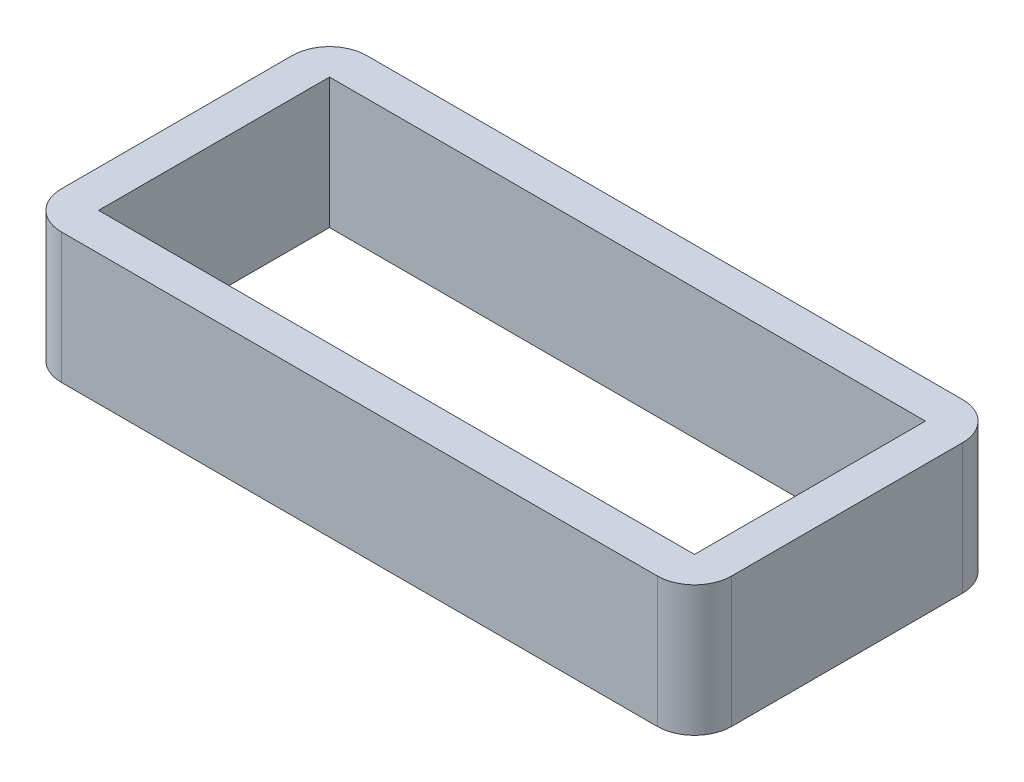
ISO-10303-21;
HEADER;
FILE_DESCRIPTION(('STEP AP214'),'2;1');
FILE_NAME('part.step','',(''),(''),'','','');
FILE_SCHEMA(('AUTOMOTIVE_DESIGN { 1 0 10303 214 1 1 1 1 }'));
ENDSEC;
DATA;
#1=APPLICATION_CONTEXT('core data for automotive mechanical design processes');
#2=APPLICATION_PROTOCOL_DEFINITION('international standard','automotive_design',2000,#1);
#3=PRODUCT_CONTEXT('',#1,'mechanical');
#4=PRODUCT('Part','Part','',(#3));
#5=PRODUCT_RELATED_PRODUCT_CATEGORY('part','',(#4));
#6=PRODUCT_DEFINITION_FORMATION('','',#4);
#7=PRODUCT_DEFINITION_CONTEXT('part definition',#1,'design');
#8=PRODUCT_DEFINITION('design','',#6,#7);
#9=PRODUCT_DEFINITION_SHAPE('','',#8);
#10=(LENGTH_UNIT() NAMED_UNIT(*) SI_UNIT(.MILLI.,.METRE.));
#11=(NAMED_UNIT(*) PLANE_ANGLE_UNIT() SI_UNIT($,.RADIAN.));
#12=(NAMED_UNIT(*) SI_UNIT($,.STERADIAN.) SOLID_ANGLE_UNIT());
#13=UNCERTAINTY_MEASURE_WITH_UNIT(LENGTH_MEASURE(1.E-05),#10,'distance_accuracy_value','');
#14=(GEOMETRIC_REPRESENTATION_CONTEXT(3) GLOBAL_UNCERTAINTY_ASSIGNED_CONTEXT((#13)) GLOBAL_UNIT_ASSIGNED_CONTEXT((#10,
#11,#12)) REPRESENTATION_CONTEXT('',''));
#15=CARTESIAN_POINT('',(0.,0.,0.));
#16=DIRECTION('',(0.,0.,1.));
#17=DIRECTION('',(1.,0.,0.));
#18=AXIS2_PLACEMENT_3D('',#15,#16,#17);
#19=CARTESIAN_POINT('',(-16.,-39.5595753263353,6.2));
#20=DIRECTION('',(0.,1.,0.));
#21=DIRECTION('',(0.,0.,1.));
#22=AXIS2_PLACEMENT_3D('',#19,#20,#21);
#23=CYLINDRICAL_SURFACE('',#22,1.99999999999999);
#24=DIRECTION('',(0.,1.,0.));
#25=VECTOR('',#24,1.);
#26=CARTESIAN_POINT('',(-18.,-39.5595753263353,6.20000000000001));
#27=LINE('',#26,#25);
#28=CARTESIAN_POINT('',(-18.,0.,6.20000000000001));
#29=VERTEX_POINT('',#28);
#30=CARTESIAN_POINT('',(-18.,7.,6.20000000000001));
#31=VERTEX_POINT('',#30);
#32=EDGE_CURVE('E134',#29,#31,#27,.T.);
#33=ORIENTED_EDGE('',*,*,#32,.F.);
#34=CARTESIAN_POINT('',(-16.,0.,6.2));
#35=DIRECTION('',(0.,-1.,0.));
#36=DIRECTION('',(0.,0.,-1.));
#37=AXIS2_PLACEMENT_3D('',#34,#35,#36);
#38=CIRCLE('',#37,1.99999999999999);
#39=CARTESIAN_POINT('',(-16.,0.,8.19999999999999));
#40=VERTEX_POINT('',#39);
#41=EDGE_CURVE('E128',#29,#40,#38,.F.);
#42=ORIENTED_EDGE('',*,*,#41,.T.);
#43=DIRECTION('',(0.,1.,0.));
#44=VECTOR('',#43,1.);
#45=CARTESIAN_POINT('',(-16.,-39.5595753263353,8.19999999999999));
#46=LINE('',#45,#44);
#47=CARTESIAN_POINT('',(-16.,7.,8.19999999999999));
#48=VERTEX_POINT('',#47);
#49=EDGE_CURVE('E130',#40,#48,#46,.T.);
#50=ORIENTED_EDGE('',*,*,#49,.T.);
#51=CARTESIAN_POINT('',(-16.,7.,6.2));
#52=DIRECTION('',(0.,1.,0.));
#53=DIRECTION('',(0.,0.,1.));
#54=AXIS2_PLACEMENT_3D('',#51,#52,#53);
#55=CIRCLE('',#54,1.99999999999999);
#56=EDGE_CURVE('E176',#31,#48,#55,.T.);
#57=ORIENTED_EDGE('',*,*,#56,.F.);
#58=EDGE_LOOP('',(#33,#42,#50,#57));
#59=FACE_BOUND('',#58,.T.);
#60=ADVANCED_FACE('F16',(#59),#23,.T.);
#61=CARTESIAN_POINT('',(-18.,-39.5595753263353,-6.2));
#62=DIRECTION('',(-1.,0.,0.));
#63=DIRECTION('',(0.,0.,1.));
#64=AXIS2_PLACEMENT_3D('',#61,#62,#63);
#65=PLANE('',#64);
#66=DIRECTION('',(0.,1.,0.));
#67=VECTOR('',#66,1.);
#68=CARTESIAN_POINT('',(-18.,-39.5595753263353,-6.2));
#69=LINE('',#68,#67);
#70=CARTESIAN_POINT('',(-18.,0.,-6.2));
#71=VERTEX_POINT('',#70);
#72=CARTESIAN_POINT('',(-18.,7.,-6.2));
#73=VERTEX_POINT('',#72);
#74=EDGE_CURVE('E138',#71,#73,#69,.T.);
#75=ORIENTED_EDGE('',*,*,#74,.F.);
#76=DIRECTION('',(0.,0.,1.));
#77=VECTOR('',#76,1.);
#78=CARTESIAN_POINT('',(-18.,0.,-6.2));
#79=LINE('',#78,#77);
#80=EDGE_CURVE('E131',#71,#29,#79,.T.);
#81=ORIENTED_EDGE('',*,*,#80,.T.);
#82=ORIENTED_EDGE('',*,*,#32,.T.);
#83=DIRECTION('',(0.,0.,1.));
#84=VECTOR('',#83,1.);
#85=CARTESIAN_POINT('',(-18.,7.,-6.2));
#86=LINE('',#85,#84);
#87=EDGE_CURVE('E123',#73,#31,#86,.T.);
#88=ORIENTED_EDGE('',*,*,#87,.F.);
#89=EDGE_LOOP('',(#75,#81,#82,#88));
#90=FACE_BOUND('',#89,.T.);
#91=ADVANCED_FACE('F208',(#90),#65,.T.);
#92=CARTESIAN_POINT('',(-16.,-39.5595753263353,-6.2));
#93=DIRECTION('',(0.,1.,0.));
#94=DIRECTION('',(0.,0.,1.));
#95=AXIS2_PLACEMENT_3D('',#92,#93,#94);
#96=CYLINDRICAL_SURFACE('',#95,1.99999999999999);
#97=DIRECTION('',(0.,1.,0.));
#98=VECTOR('',#97,1.);
#99=CARTESIAN_POINT('',(-16.,-39.5595753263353,-8.19999999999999));
#100=LINE('',#99,#98);
#101=CARTESIAN_POINT('',(-16.,0.,-8.19999999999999));
#102=VERTEX_POINT('',#101);
#103=CARTESIAN_POINT('',(-16.,7.,-8.19999999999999));
#104=VERTEX_POINT('',#103);
#105=EDGE_CURVE('E142',#102,#104,#100,.T.);
#106=ORIENTED_EDGE('',*,*,#105,.F.);
#107=CARTESIAN_POINT('',(-16.,0.,-6.2));
#108=DIRECTION('',(0.,-1.,0.));
#109=DIRECTION('',(0.,0.,-1.));
#110=AXIS2_PLACEMENT_3D('',#107,#108,#109);
#111=CIRCLE('',#110,1.99999999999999);
#112=EDGE_CURVE('E135',#102,#71,#111,.F.);
#113=ORIENTED_EDGE('',*,*,#112,.T.);
#114=ORIENTED_EDGE('',*,*,#74,.T.);
#115=CARTESIAN_POINT('',(-16.,7.,-6.2));
#116=DIRECTION('',(0.,1.,0.));
#117=DIRECTION('',(0.,0.,1.));
#118=AXIS2_PLACEMENT_3D('',#115,#116,#117);
#119=CIRCLE('',#118,1.99999999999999);
#120=EDGE_CURVE('E200',#104,#73,#119,.T.);
#121=ORIENTED_EDGE('',*,*,#120,.F.);
#122=EDGE_LOOP('',(#106,#113,#114,#121));
#123=FACE_BOUND('',#122,.T.);
#124=ADVANCED_FACE('F232',(#123),#96,.T.);
#125=CARTESIAN_POINT('',(16.,-39.5595753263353,-8.2));
#126=DIRECTION('',(0.,0.,-1.));
#127=DIRECTION('',(-1.,0.,0.));
#128=AXIS2_PLACEMENT_3D('',#125,#126,#127);
#129=PLANE('',#128);
#130=DIRECTION('',(0.,1.,0.));
#131=VECTOR('',#130,1.);
#132=CARTESIAN_POINT('',(16.,-39.5595753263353,-8.2));
#133=LINE('',#132,#131);
#134=CARTESIAN_POINT('',(16.,0.,-8.2));
#135=VERTEX_POINT('',#134);
#136=CARTESIAN_POINT('',(16.,7.,-8.2));
#137=VERTEX_POINT('',#136);
#138=EDGE_CURVE('E146',#135,#137,#133,.T.);
#139=ORIENTED_EDGE('',*,*,#138,.F.);
#140=DIRECTION('',(-1.,0.,0.));
#141=VECTOR('',#140,1.);
#142=CARTESIAN_POINT('',(16.,0.,-8.2));
#143=LINE('',#142,#141);
#144=EDGE_CURVE('E139',#135,#102,#143,.T.);
#145=ORIENTED_EDGE('',*,*,#144,.T.);
#146=ORIENTED_EDGE('',*,*,#105,.T.);
#147=DIRECTION('',(-1.,0.,0.));
#148=VECTOR('',#147,1.);
#149=CARTESIAN_POINT('',(16.,7.,-8.2));
#150=LINE('',#149,#148);
#151=EDGE_CURVE('E197',#137,#104,#150,.T.);
#152=ORIENTED_EDGE('',*,*,#151,.F.);
#153=EDGE_LOOP('',(#139,#145,#146,#152));
#154=FACE_BOUND('',#153,.T.);
#155=ADVANCED_FACE('F229',(#154),#129,.T.);
#156=CARTESIAN_POINT('',(16.,-39.5595753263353,-6.2));
#157=DIRECTION('',(0.,1.,0.));
#158=DIRECTION('',(0.,0.,1.));
#159=AXIS2_PLACEMENT_3D('',#156,#157,#158);
#160=CYLINDRICAL_SURFACE('',#159,2.);
#161=DIRECTION('',(0.,1.,0.));
#162=VECTOR('',#161,1.);
#163=CARTESIAN_POINT('',(18.,-39.5595753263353,-6.2));
#164=LINE('',#163,#162);
#165=CARTESIAN_POINT('',(18.,0.,-6.2));
#166=VERTEX_POINT('',#165);
#167=CARTESIAN_POINT('',(18.,7.,-6.2));
#168=VERTEX_POINT('',#167);
#169=EDGE_CURVE('E150',#166,#168,#164,.T.);
#170=ORIENTED_EDGE('',*,*,#169,.F.);
#171=CARTESIAN_POINT('',(16.,0.,-6.2));
#172=DIRECTION('',(0.,-1.,0.));
#173=DIRECTION('',(0.,0.,-1.));
#174=AXIS2_PLACEMENT_3D('',#171,#172,#173);
#175=CIRCLE('',#174,2.);
#176=EDGE_CURVE('E143',#166,#135,#175,.F.);
#177=ORIENTED_EDGE('',*,*,#176,.T.);
#178=ORIENTED_EDGE('',*,*,#138,.T.);
#179=CARTESIAN_POINT('',(16.,7.,-6.2));
#180=DIRECTION('',(0.,1.,0.));
#181=DIRECTION('',(0.,0.,1.));
#182=AXIS2_PLACEMENT_3D('',#179,#180,#181);
#183=CIRCLE('',#182,2.);
#184=EDGE_CURVE('E194',#168,#137,#183,.T.);
#185=ORIENTED_EDGE('',*,*,#184,.F.);
#186=EDGE_LOOP('',(#170,#177,#178,#185));
#187=FACE_BOUND('',#186,.T.);
#188=ADVANCED_FACE('F225',(#187),#160,.T.);
#189=CARTESIAN_POINT('',(18.,-39.5595753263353,6.20000000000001));
#190=DIRECTION('',(1.,0.,0.));
#191=DIRECTION('',(0.,0.,-1.));
#192=AXIS2_PLACEMENT_3D('',#189,#190,#191);
#193=PLANE('',#192);
#194=DIRECTION('',(0.,1.,0.));
#195=VECTOR('',#194,1.);
#196=CARTESIAN_POINT('',(18.,-39.5595753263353,6.20000000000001));
#197=LINE('',#196,#195);
#198=CARTESIAN_POINT('',(18.,0.,6.20000000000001));
#199=VERTEX_POINT('',#198);
#200=CARTESIAN_POINT('',(18.,7.,6.20000000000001));
#201=VERTEX_POINT('',#200);
#202=EDGE_CURVE('E153',#199,#201,#197,.T.);
#203=ORIENTED_EDGE('',*,*,#202,.F.);
#204=DIRECTION('',(0.,0.,-1.));
#205=VECTOR('',#204,1.);
#206=CARTESIAN_POINT('',(18.,0.,6.20000000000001));
#207=LINE('',#206,#205);
#208=EDGE_CURVE('E147',#199,#166,#207,.T.);
#209=ORIENTED_EDGE('',*,*,#208,.T.);
#210=ORIENTED_EDGE('',*,*,#169,.T.);
#211=DIRECTION('',(0.,0.,-1.));
#212=VECTOR('',#211,1.);
#213=CARTESIAN_POINT('',(18.,7.,6.20000000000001));
#214=LINE('',#213,#212);
#215=EDGE_CURVE('E189',#201,#168,#214,.T.);
#216=ORIENTED_EDGE('',*,*,#215,.F.);
#217=EDGE_LOOP('',(#203,#209,#210,#216));
#218=FACE_BOUND('',#217,.T.);
#219=ADVANCED_FACE('F222',(#218),#193,.T.);
#220=CARTESIAN_POINT('',(16.,-39.5595753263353,6.2));
#221=DIRECTION('',(0.,1.,0.));
#222=DIRECTION('',(0.,0.,1.));
#223=AXIS2_PLACEMENT_3D('',#220,#221,#222);
#224=CYLINDRICAL_SURFACE('',#223,2.);
#225=DIRECTION('',(0.,1.,0.));
#226=VECTOR('',#225,1.);
#227=CARTESIAN_POINT('',(16.,-39.5595753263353,8.19999999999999));
#228=LINE('',#227,#226);
#229=CARTESIAN_POINT('',(16.,0.,8.19999999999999));
#230=VERTEX_POINT('',#229);
#231=CARTESIAN_POINT('',(16.,7.,8.19999999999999));
#232=VERTEX_POINT('',#231);
#233=EDGE_CURVE('E161',#230,#232,#228,.T.);
#234=ORIENTED_EDGE('',*,*,#233,.F.);
#235=CARTESIAN_POINT('',(16.,0.,6.2));
#236=DIRECTION('',(0.,-1.,0.));
#237=DIRECTION('',(0.,0.,-1.));
#238=AXIS2_PLACEMENT_3D('',#235,#236,#237);
#239=CIRCLE('',#238,2.);
#240=EDGE_CURVE('E151',#230,#199,#239,.F.);
#241=ORIENTED_EDGE('',*,*,#240,.T.);
#242=ORIENTED_EDGE('',*,*,#202,.T.);
#243=CARTESIAN_POINT('',(16.,7.,6.2));
#244=DIRECTION('',(0.,1.,0.));
#245=DIRECTION('',(0.,0.,1.));
#246=AXIS2_PLACEMENT_3D('',#243,#244,#245);
#247=CIRCLE('',#246,2.);
#248=EDGE_CURVE('E186',#232,#201,#247,.T.);
#249=ORIENTED_EDGE('',*,*,#248,.F.);
#250=EDGE_LOOP('',(#234,#241,#242,#249));
#251=FACE_BOUND('',#250,.T.);
#252=ADVANCED_FACE('F217',(#251),#224,.T.);
#253=CARTESIAN_POINT('',(-16.,-39.5595753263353,8.19999999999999));
#254=DIRECTION('',(0.,0.,1.));
#255=DIRECTION('',(1.,0.,0.));
#256=AXIS2_PLACEMENT_3D('',#253,#254,#255);
#257=PLANE('',#256);
#258=ORIENTED_EDGE('',*,*,#49,.F.);
#259=DIRECTION('',(1.,0.,0.));
#260=VECTOR('',#259,1.);
#261=CARTESIAN_POINT('',(-16.,0.,8.19999999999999));
#262=LINE('',#261,#260);
#263=EDGE_CURVE('E34',#40,#230,#262,.T.);
#264=ORIENTED_EDGE('',*,*,#263,.T.);
#265=ORIENTED_EDGE('',*,*,#233,.T.);
#266=DIRECTION('',(1.,0.,0.));
#267=VECTOR('',#266,1.);
#268=CARTESIAN_POINT('',(-16.,7.,8.19999999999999));
#269=LINE('',#268,#267);
#270=EDGE_CURVE('E181',#48,#232,#269,.T.);
#271=ORIENTED_EDGE('',*,*,#270,.F.);
#272=EDGE_LOOP('',(#258,#264,#265,#271));
#273=FACE_BOUND('',#272,.T.);
#274=ADVANCED_FACE('F213',(#273),#257,.T.);
#275=CARTESIAN_POINT('',(-16.,-39.5595753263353,-6.2));
#276=DIRECTION('',(-1.,0.,0.));
#277=DIRECTION('',(0.,0.,1.));
#278=AXIS2_PLACEMENT_3D('',#275,#276,#277);
#279=PLANE('',#278);
#280=DIRECTION('',(0.,0.,1.));
#281=VECTOR('',#280,1.);
#282=CARTESIAN_POINT('',(-16.,0.,-6.2));
#283=LINE('',#282,#281);
#284=CARTESIAN_POINT('',(-16.,0.,-6.2));
#285=VERTEX_POINT('',#284);
#286=CARTESIAN_POINT('',(-16.,0.,6.19999999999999));
#287=VERTEX_POINT('',#286);
#288=EDGE_CURVE('E104',#285,#287,#283,.T.);
#289=ORIENTED_EDGE('',*,*,#288,.F.);
#290=DIRECTION('',(0.,1.,0.));
#291=VECTOR('',#290,1.);
#292=CARTESIAN_POINT('',(-16.,-39.5595753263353,-6.2));
#293=LINE('',#292,#291);
#294=CARTESIAN_POINT('',(-16.,7.,-6.2));
#295=VERTEX_POINT('',#294);
#296=EDGE_CURVE('E163',#285,#295,#293,.T.);
#297=ORIENTED_EDGE('',*,*,#296,.T.);
#298=DIRECTION('',(0.,0.,1.));
#299=VECTOR('',#298,1.);
#300=CARTESIAN_POINT('',(-16.,7.,-6.2));
#301=LINE('',#300,#299);
#302=CARTESIAN_POINT('',(-16.,7.,6.19999999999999));
#303=VERTEX_POINT('',#302);
#304=EDGE_CURVE('E107',#295,#303,#301,.T.);
#305=ORIENTED_EDGE('',*,*,#304,.T.);
#306=DIRECTION('',(0.,1.,0.));
#307=VECTOR('',#306,1.);
#308=CARTESIAN_POINT('',(-16.,-39.5595753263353,6.19999999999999));
#309=LINE('',#308,#307);
#310=EDGE_CURVE('E20',#287,#303,#309,.T.);
#311=ORIENTED_EDGE('',*,*,#310,.F.);
#312=EDGE_LOOP('',(#289,#297,#305,#311));
#313=FACE_BOUND('',#312,.T.);
#314=ADVANCED_FACE('F102',(#313),#279,.F.);
#315=CARTESIAN_POINT('',(16.,-39.5595753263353,-6.2));
#316=DIRECTION('',(0.,0.,-1.));
#317=DIRECTION('',(-1.,0.,0.));
#318=AXIS2_PLACEMENT_3D('',#315,#316,#317);
#319=PLANE('',#318);
#320=DIRECTION('',(-1.,0.,0.));
#321=VECTOR('',#320,1.);
#322=CARTESIAN_POINT('',(16.,0.,-6.2));
#323=LINE('',#322,#321);
#324=CARTESIAN_POINT('',(16.,0.,-6.2));
#325=VERTEX_POINT('',#324);
#326=EDGE_CURVE('E121',#325,#285,#323,.T.);
#327=ORIENTED_EDGE('',*,*,#326,.F.);
#328=DIRECTION('',(0.,1.,0.));
#329=VECTOR('',#328,1.);
#330=CARTESIAN_POINT('',(16.,-39.5595753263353,-6.2));
#331=LINE('',#330,#329);
#332=CARTESIAN_POINT('',(16.,7.,-6.2));
#333=VERTEX_POINT('',#332);
#334=EDGE_CURVE('E166',#325,#333,#331,.T.);
#335=ORIENTED_EDGE('',*,*,#334,.T.);
#336=DIRECTION('',(-1.,0.,0.));
#337=VECTOR('',#336,1.);
#338=CARTESIAN_POINT('',(16.,7.,-6.2));
#339=LINE('',#338,#337);
#340=EDGE_CURVE('E167',#333,#295,#339,.T.);
#341=ORIENTED_EDGE('',*,*,#340,.T.);
#342=ORIENTED_EDGE('',*,*,#296,.F.);
#343=EDGE_LOOP('',(#327,#335,#341,#342));
#344=FACE_BOUND('',#343,.T.);
#345=ADVANCED_FACE('F255',(#344),#319,.F.);
#346=CARTESIAN_POINT('',(16.,-39.5595753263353,6.19999999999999));
#347=DIRECTION('',(1.,0.,0.));
#348=DIRECTION('',(0.,0.,-1.));
#349=AXIS2_PLACEMENT_3D('',#346,#347,#348);
#350=PLANE('',#349);
#351=DIRECTION('',(0.,0.,-1.));
#352=VECTOR('',#351,1.);
#353=CARTESIAN_POINT('',(16.,0.,6.19999999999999));
#354=LINE('',#353,#352);
#355=CARTESIAN_POINT('',(16.,0.,6.19999999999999));
#356=VERTEX_POINT('',#355);
#357=EDGE_CURVE('E11',#356,#325,#354,.T.);
#358=ORIENTED_EDGE('',*,*,#357,.F.);
#359=DIRECTION('',(0.,1.,0.));
#360=VECTOR('',#359,1.);
#361=CARTESIAN_POINT('',(16.,-39.5595753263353,6.19999999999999));
#362=LINE('',#361,#360);
#363=CARTESIAN_POINT('',(16.,7.,6.19999999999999));
#364=VERTEX_POINT('',#363);
#365=EDGE_CURVE('E116',#356,#364,#362,.T.);
#366=ORIENTED_EDGE('',*,*,#365,.T.);
#367=DIRECTION('',(0.,0.,-1.));
#368=VECTOR('',#367,1.);
#369=CARTESIAN_POINT('',(16.,7.,6.19999999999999));
#370=LINE('',#369,#368);
#371=EDGE_CURVE('E112',#364,#333,#370,.T.);
#372=ORIENTED_EDGE('',*,*,#371,.T.);
#373=ORIENTED_EDGE('',*,*,#334,.F.);
#374=EDGE_LOOP('',(#358,#366,#372,#373));
#375=FACE_BOUND('',#374,.T.);
#376=ADVANCED_FACE('F252',(#375),#350,.F.);
#377=CARTESIAN_POINT('',(-16.,-39.5595753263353,6.19999999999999));
#378=DIRECTION('',(0.,0.,1.));
#379=DIRECTION('',(1.,0.,0.));
#380=AXIS2_PLACEMENT_3D('',#377,#378,#379);
#381=PLANE('',#380);
#382=DIRECTION('',(1.,0.,0.));
#383=VECTOR('',#382,1.);
#384=CARTESIAN_POINT('',(-16.,0.,6.19999999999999));
#385=LINE('',#384,#383);
#386=EDGE_CURVE('E26',#287,#356,#385,.T.);
#387=ORIENTED_EDGE('',*,*,#386,.F.);
#388=ORIENTED_EDGE('',*,*,#310,.T.);
#389=DIRECTION('',(1.,0.,0.));
#390=VECTOR('',#389,1.);
#391=CARTESIAN_POINT('',(-16.,7.,6.19999999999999));
#392=LINE('',#391,#390);
#393=EDGE_CURVE('E111',#303,#364,#392,.T.);
#394=ORIENTED_EDGE('',*,*,#393,.T.);
#395=ORIENTED_EDGE('',*,*,#365,.F.);
#396=EDGE_LOOP('',(#387,#388,#394,#395));
#397=FACE_BOUND('',#396,.T.);
#398=ADVANCED_FACE('F115',(#397),#381,.F.);
#399=CARTESIAN_POINT('',(-16.,7.,6.2));
#400=DIRECTION('',(0.,1.,0.));
#401=DIRECTION('',(0.,0.,1.));
#402=AXIS2_PLACEMENT_3D('',#399,#400,#401);
#403=PLANE('',#402);
#404=ORIENTED_EDGE('',*,*,#304,.F.);
#405=ORIENTED_EDGE('',*,*,#340,.F.);
#406=ORIENTED_EDGE('',*,*,#371,.F.);
#407=ORIENTED_EDGE('',*,*,#393,.F.);
#408=EDGE_LOOP('',(#404,#405,#406,#407));
#409=FACE_BOUND('',#408,.T.);
#410=ORIENTED_EDGE('',*,*,#56,.T.);
#411=ORIENTED_EDGE('',*,*,#270,.T.);
#412=ORIENTED_EDGE('',*,*,#248,.T.);
#413=ORIENTED_EDGE('',*,*,#215,.T.);
#414=ORIENTED_EDGE('',*,*,#184,.T.);
#415=ORIENTED_EDGE('',*,*,#151,.T.);
#416=ORIENTED_EDGE('',*,*,#120,.T.);
#417=ORIENTED_EDGE('',*,*,#87,.T.);
#418=EDGE_LOOP('',(#410,#411,#412,#413,#414,#415,#416,#417));
#419=FACE_BOUND('',#418,.T.);
#420=ADVANCED_FACE('F204',(#409,#419),#403,.T.);
#421=CARTESIAN_POINT('',(-51.5,0.,-30.));
#422=DIRECTION('',(0.,-1.,0.));
#423=DIRECTION('',(0.,0.,-1.));
#424=AXIS2_PLACEMENT_3D('',#421,#422,#423);
#425=PLANE('',#424);
#426=ORIENTED_EDGE('',*,*,#41,.F.);
#427=ORIENTED_EDGE('',*,*,#80,.F.);
#428=ORIENTED_EDGE('',*,*,#112,.F.);
#429=ORIENTED_EDGE('',*,*,#144,.F.);
#430=ORIENTED_EDGE('',*,*,#176,.F.);
#431=ORIENTED_EDGE('',*,*,#208,.F.);
#432=ORIENTED_EDGE('',*,*,#240,.F.);
#433=ORIENTED_EDGE('',*,*,#263,.F.);
#434=EDGE_LOOP('',(#426,#427,#428,#429,#430,#431,#432,#433));
#435=FACE_BOUND('',#434,.T.);
#436=ORIENTED_EDGE('',*,*,#326,.T.);
#437=ORIENTED_EDGE('',*,*,#288,.T.);
#438=ORIENTED_EDGE('',*,*,#386,.T.);
#439=ORIENTED_EDGE('',*,*,#357,.T.);
#440=EDGE_LOOP('',(#436,#437,#438,#439));
#441=FACE_BOUND('',#440,.T.);
#442=ADVANCED_FACE('F18',(#435,#441),#425,.T.);
#443=CLOSED_SHELL('',(#60,#91,#124,#155,#188,#219,#252,#274,#314,#345,#376,#398,#420,#442));
#444=MANIFOLD_SOLID_BREP('B1',#443);
#445=ADVANCED_BREP_SHAPE_REPRESENTATION('',(#18,#444),#14);
#446=SHAPE_DEFINITION_REPRESENTATION(#9,#445);
ENDSEC;
END-ISO-10303-21;
